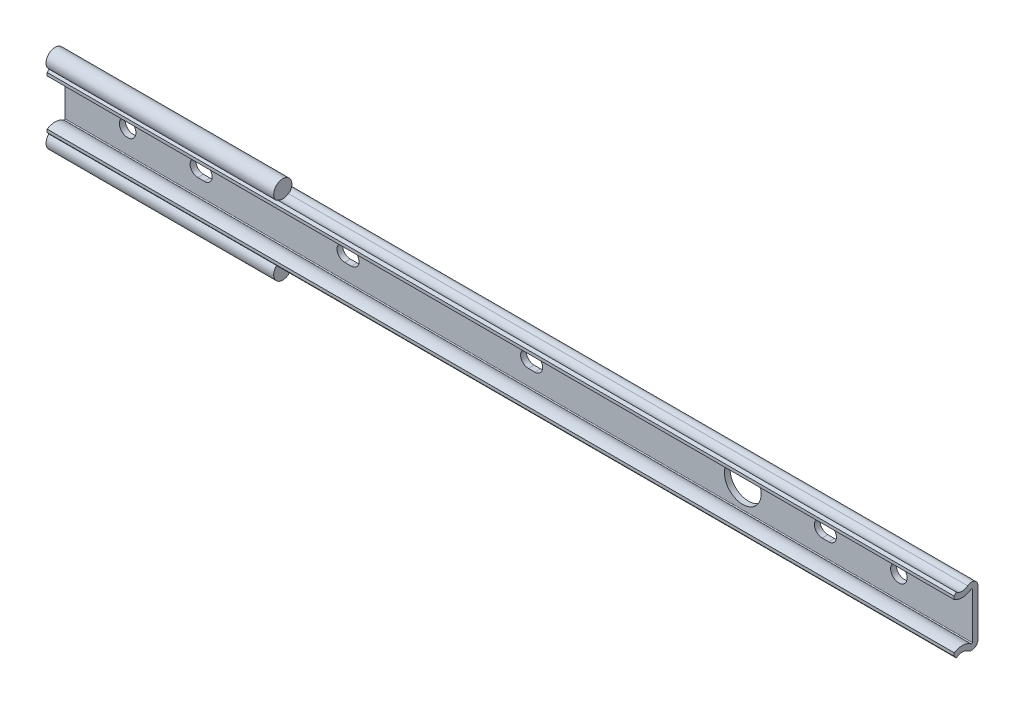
ISO-10303-21;
HEADER;
FILE_DESCRIPTION(('STEP AP214'),'2;1');
FILE_NAME('part.step','',(''),(''),'','','');
FILE_SCHEMA(('AUTOMOTIVE_DESIGN { 1 0 10303 214 1 1 1 1 }'));
ENDSEC;
DATA;
#1=APPLICATION_CONTEXT('core data for automotive mechanical design processes');
#2=APPLICATION_PROTOCOL_DEFINITION('international standard','automotive_design',2000,#1);
#3=PRODUCT_CONTEXT('',#1,'mechanical');
#4=PRODUCT('Part','Part','',(#3));
#5=PRODUCT_RELATED_PRODUCT_CATEGORY('part','',(#4));
#6=PRODUCT_DEFINITION_FORMATION('','',#4);
#7=PRODUCT_DEFINITION_CONTEXT('part definition',#1,'design');
#8=PRODUCT_DEFINITION('design','',#6,#7);
#9=PRODUCT_DEFINITION_SHAPE('','',#8);
#10=(LENGTH_UNIT() NAMED_UNIT(*) SI_UNIT(.MILLI.,.METRE.));
#11=(NAMED_UNIT(*) PLANE_ANGLE_UNIT() SI_UNIT($,.RADIAN.));
#12=(NAMED_UNIT(*) SI_UNIT($,.STERADIAN.) SOLID_ANGLE_UNIT());
#13=UNCERTAINTY_MEASURE_WITH_UNIT(LENGTH_MEASURE(1.E-05),#10,'distance_accuracy_value','');
#14=(GEOMETRIC_REPRESENTATION_CONTEXT(3) GLOBAL_UNCERTAINTY_ASSIGNED_CONTEXT((#13)) GLOBAL_UNIT_ASSIGNED_CONTEXT((#10,
#11,#12)) REPRESENTATION_CONTEXT('',''));
#15=CARTESIAN_POINT('',(0.,0.,0.));
#16=DIRECTION('',(0.,0.,1.));
#17=DIRECTION('',(1.,0.,0.));
#18=AXIS2_PLACEMENT_3D('',#15,#16,#17);
#19=CARTESIAN_POINT('',(230.,9.67006993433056,4.30999988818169));
#20=DIRECTION('',(-1.,0.,0.));
#21=DIRECTION('',(0.,1.,0.));
#22=AXIS2_PLACEMENT_3D('',#19,#20,#21);
#23=CYLINDRICAL_SURFACE('',#22,2.48);
#24=DIRECTION('',(-1.,0.,0.));
#25=VECTOR('',#24,1.);
#26=CARTESIAN_POINT('',(230.,7.6958095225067,2.80910154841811));
#27=LINE('',#26,#25);
#28=CARTESIAN_POINT('',(230.,7.6958095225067,2.80910154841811));
#29=VERTEX_POINT('',#28);
#30=CARTESIAN_POINT('',(45.,7.6958095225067,2.80910154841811));
#31=VERTEX_POINT('',#30);
#32=EDGE_CURVE('E482',#29,#31,#27,.T.);
#33=ORIENTED_EDGE('',*,*,#32,.T.);
#34=CARTESIAN_POINT('',(45.,9.67006993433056,4.30999988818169));
#35=DIRECTION('',(-1.,0.,0.));
#36=DIRECTION('',(0.,0.,1.));
#37=AXIS2_PLACEMENT_3D('',#34,#35,#36);
#38=CIRCLE('',#37,2.48);
#39=CARTESIAN_POINT('',(45.,7.77027971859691,5.9041131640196));
#40=VERTEX_POINT('',#39);
#41=EDGE_CURVE('E264',#31,#40,#38,.T.);
#42=ORIENTED_EDGE('',*,*,#41,.T.);
#43=DIRECTION('',(-1.,0.,0.));
#44=VECTOR('',#43,1.);
#45=CARTESIAN_POINT('',(230.,7.77027971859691,5.9041131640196));
#46=LINE('',#45,#44);
#47=CARTESIAN_POINT('',(230.,7.77027971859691,5.9041131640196));
#48=VERTEX_POINT('',#47);
#49=EDGE_CURVE('E485',#48,#40,#46,.T.);
#50=ORIENTED_EDGE('',*,*,#49,.F.);
#51=CARTESIAN_POINT('',(230.,9.67006993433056,4.30999988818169));
#52=DIRECTION('',(1.,0.,0.));
#53=DIRECTION('',(0.,-1.,0.));
#54=AXIS2_PLACEMENT_3D('',#51,#52,#53);
#55=CIRCLE('',#54,2.48);
#56=EDGE_CURVE('E469',#48,#29,#55,.T.);
#57=ORIENTED_EDGE('',*,*,#56,.T.);
#58=EDGE_LOOP('',(#33,#42,#50,#57));
#59=FACE_BOUND('',#58,.T.);
#60=ADVANCED_FACE('F14',(#59),#23,.F.);
#61=CARTESIAN_POINT('',(60.9,2.10000000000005,4.92000017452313));
#62=DIRECTION('',(0.,1.,0.));
#63=DIRECTION('',(0.,0.,1.));
#64=AXIS2_PLACEMENT_3D('',#61,#62,#63);
#65=PLANE('',#64);
#66=DIRECTION('',(0.,0.,-1.));
#67=VECTOR('',#66,1.);
#68=CARTESIAN_POINT('',(59.1,2.10000000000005,4.92000017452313));
#69=LINE('',#68,#67);
#70=CARTESIAN_POINT('',(59.1,2.10000000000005,1.54999999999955));
#71=VERTEX_POINT('',#70);
#72=CARTESIAN_POINT('',(59.1,2.10000000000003,0.));
#73=VERTEX_POINT('',#72);
#74=EDGE_CURVE('E428',#71,#73,#69,.T.);
#75=ORIENTED_EDGE('',*,*,#74,.T.);
#76=DIRECTION('',(1.,0.,0.));
#77=VECTOR('',#76,1.);
#78=CARTESIAN_POINT('',(60.9,2.10000000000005,0.));
#79=LINE('',#78,#77);
#80=CARTESIAN_POINT('',(60.9,2.10000000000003,0.));
#81=VERTEX_POINT('',#80);
#82=EDGE_CURVE('E283',#73,#81,#79,.T.);
#83=ORIENTED_EDGE('',*,*,#82,.T.);
#84=DIRECTION('',(0.,0.,-1.));
#85=VECTOR('',#84,1.);
#86=CARTESIAN_POINT('',(60.9,2.10000000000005,4.92000017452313));
#87=LINE('',#86,#85);
#88=CARTESIAN_POINT('',(60.9,2.10000000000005,1.54999999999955));
#89=VERTEX_POINT('',#88);
#90=EDGE_CURVE('E424',#89,#81,#87,.T.);
#91=ORIENTED_EDGE('',*,*,#90,.F.);
#92=DIRECTION('',(1.,0.,0.));
#93=VECTOR('',#92,1.);
#94=CARTESIAN_POINT('',(230.,2.10000000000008,1.54999999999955));
#95=LINE('',#94,#93);
#96=EDGE_CURVE('E337',#71,#89,#95,.T.);
#97=ORIENTED_EDGE('',*,*,#96,.F.);
#98=EDGE_LOOP('',(#75,#83,#91,#97));
#99=FACE_BOUND('',#98,.T.);
#100=ADVANCED_FACE('F610',(#99),#65,.F.);
#101=CARTESIAN_POINT('',(59.1,0.,4.92000017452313));
#102=DIRECTION('',(0.,0.,-1.));
#103=DIRECTION('',(0.,1.,0.));
#104=AXIS2_PLACEMENT_3D('',#101,#102,#103);
#105=CYLINDRICAL_SURFACE('',#104,2.1);
#106=DIRECTION('',(0.,0.,-1.));
#107=VECTOR('',#106,1.);
#108=CARTESIAN_POINT('',(59.1,-2.1,4.92000017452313));
#109=LINE('',#108,#107);
#110=CARTESIAN_POINT('',(59.1,-2.1,1.54999999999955));
#111=VERTEX_POINT('',#110);
#112=CARTESIAN_POINT('',(59.1,-2.1,0.));
#113=VERTEX_POINT('',#112);
#114=EDGE_CURVE('E431',#111,#113,#109,.T.);
#115=ORIENTED_EDGE('',*,*,#114,.T.);
#116=CARTESIAN_POINT('',(59.1,0.,0.));
#117=DIRECTION('',(0.,0.,1.));
#118=DIRECTION('',(1.,0.,0.));
#119=AXIS2_PLACEMENT_3D('',#116,#117,#118);
#120=CIRCLE('',#119,2.1);
#121=EDGE_CURVE('E280',#113,#73,#120,.F.);
#122=ORIENTED_EDGE('',*,*,#121,.T.);
#123=ORIENTED_EDGE('',*,*,#74,.F.);
#124=CARTESIAN_POINT('',(59.1,0.,1.54999999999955));
#125=DIRECTION('',(0.,0.,-1.));
#126=DIRECTION('',(-1.,0.,0.));
#127=AXIS2_PLACEMENT_3D('',#124,#125,#126);
#128=CIRCLE('',#127,2.1);
#129=EDGE_CURVE('E334',#111,#71,#128,.T.);
#130=ORIENTED_EDGE('',*,*,#129,.F.);
#131=EDGE_LOOP('',(#115,#122,#123,#130));
#132=FACE_BOUND('',#131,.T.);
#133=ADVANCED_FACE('F616',(#132),#105,.F.);
#134=CARTESIAN_POINT('',(190.9,2.10000000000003,4.92000017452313));
#135=DIRECTION('',(0.,1.,0.));
#136=DIRECTION('',(0.,0.,1.));
#137=AXIS2_PLACEMENT_3D('',#134,#135,#136);
#138=PLANE('',#137);
#139=DIRECTION('',(0.,0.,-1.));
#140=VECTOR('',#139,1.);
#141=CARTESIAN_POINT('',(189.1,2.10000000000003,4.92000017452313));
#142=LINE('',#141,#140);
#143=CARTESIAN_POINT('',(189.1,2.10000000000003,1.54999999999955));
#144=VERTEX_POINT('',#143);
#145=CARTESIAN_POINT('',(189.1,2.1,0.));
#146=VERTEX_POINT('',#145);
#147=EDGE_CURVE('E416',#144,#146,#142,.T.);
#148=ORIENTED_EDGE('',*,*,#147,.T.);
#149=DIRECTION('',(1.,0.,0.));
#150=VECTOR('',#149,1.);
#151=CARTESIAN_POINT('',(190.9,2.10000000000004,0.));
#152=LINE('',#151,#150);
#153=CARTESIAN_POINT('',(190.9,2.1,0.));
#154=VERTEX_POINT('',#153);
#155=EDGE_CURVE('E301',#146,#154,#152,.T.);
#156=ORIENTED_EDGE('',*,*,#155,.T.);
#157=DIRECTION('',(0.,0.,-1.));
#158=VECTOR('',#157,1.);
#159=CARTESIAN_POINT('',(190.9,2.10000000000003,4.92000017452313));
#160=LINE('',#159,#158);
#161=CARTESIAN_POINT('',(190.9,2.10000000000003,1.54999999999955));
#162=VERTEX_POINT('',#161);
#163=EDGE_CURVE('E412',#162,#154,#160,.T.);
#164=ORIENTED_EDGE('',*,*,#163,.F.);
#165=DIRECTION('',(1.,0.,0.));
#166=VECTOR('',#165,1.);
#167=CARTESIAN_POINT('',(230.,2.10000000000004,1.54999999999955));
#168=LINE('',#167,#166);
#169=EDGE_CURVE('E355',#144,#162,#168,.T.);
#170=ORIENTED_EDGE('',*,*,#169,.F.);
#171=EDGE_LOOP('',(#148,#156,#164,#170));
#172=FACE_BOUND('',#171,.T.);
#173=ADVANCED_FACE('F705',(#172),#138,.F.);
#174=CARTESIAN_POINT('',(189.1,0.,4.92000017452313));
#175=DIRECTION('',(0.,0.,-1.));
#176=DIRECTION('',(0.,1.,0.));
#177=AXIS2_PLACEMENT_3D('',#174,#175,#176);
#178=CYLINDRICAL_SURFACE('',#177,2.1);
#179=DIRECTION('',(0.,0.,-1.));
#180=VECTOR('',#179,1.);
#181=CARTESIAN_POINT('',(189.1,-2.1,4.92000017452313));
#182=LINE('',#181,#180);
#183=CARTESIAN_POINT('',(189.1,-2.1,1.54999999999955));
#184=VERTEX_POINT('',#183);
#185=CARTESIAN_POINT('',(189.1,-2.1,0.));
#186=VERTEX_POINT('',#185);
#187=EDGE_CURVE('E419',#184,#186,#182,.T.);
#188=ORIENTED_EDGE('',*,*,#187,.T.);
#189=CARTESIAN_POINT('',(189.1,0.,0.));
#190=DIRECTION('',(0.,0.,1.));
#191=DIRECTION('',(1.,0.,0.));
#192=AXIS2_PLACEMENT_3D('',#189,#190,#191);
#193=CIRCLE('',#192,2.1);
#194=EDGE_CURVE('E298',#186,#146,#193,.F.);
#195=ORIENTED_EDGE('',*,*,#194,.T.);
#196=ORIENTED_EDGE('',*,*,#147,.F.);
#197=CARTESIAN_POINT('',(189.1,0.,1.54999999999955));
#198=DIRECTION('',(0.,0.,-1.));
#199=DIRECTION('',(-1.,0.,0.));
#200=AXIS2_PLACEMENT_3D('',#197,#198,#199);
#201=CIRCLE('',#200,2.1);
#202=EDGE_CURVE('E352',#184,#144,#201,.T.);
#203=ORIENTED_EDGE('',*,*,#202,.F.);
#204=EDGE_LOOP('',(#188,#195,#196,#203));
#205=FACE_BOUND('',#204,.T.);
#206=ADVANCED_FACE('F692',(#205),#178,.F.);
#207=CARTESIAN_POINT('',(109.100000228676,-2.09326771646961,4.92000017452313));
#208=DIRECTION('',(0.,-1.,0.));
#209=DIRECTION('',(-1.,0.,0.));
#210=AXIS2_PLACEMENT_3D('',#207,#208,#209);
#211=PLANE('',#210);
#212=DIRECTION('',(0.,0.,-1.));
#213=VECTOR('',#212,1.);
#214=CARTESIAN_POINT('',(110.900000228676,-2.09326771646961,4.92000017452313));
#215=LINE('',#214,#213);
#216=CARTESIAN_POINT('',(110.900000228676,-2.09326771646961,1.54999999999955));
#217=VERTEX_POINT('',#216);
#218=CARTESIAN_POINT('',(110.900000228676,-2.09326771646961,0.));
#219=VERTEX_POINT('',#218);
#220=EDGE_CURVE('E404',#217,#219,#215,.T.);
#221=ORIENTED_EDGE('',*,*,#220,.T.);
#222=DIRECTION('',(-1.,0.,0.));
#223=VECTOR('',#222,1.);
#224=CARTESIAN_POINT('',(109.100000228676,-2.09326771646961,0.));
#225=LINE('',#224,#223);
#226=CARTESIAN_POINT('',(109.100000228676,-2.09326771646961,0.));
#227=VERTEX_POINT('',#226);
#228=EDGE_CURVE('E313',#219,#227,#225,.T.);
#229=ORIENTED_EDGE('',*,*,#228,.T.);
#230=DIRECTION('',(0.,0.,-1.));
#231=VECTOR('',#230,1.);
#232=CARTESIAN_POINT('',(109.100000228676,-2.09326771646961,4.92000017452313));
#233=LINE('',#232,#231);
#234=CARTESIAN_POINT('',(109.100000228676,-2.09326771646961,1.54999999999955));
#235=VERTEX_POINT('',#234);
#236=EDGE_CURVE('E400',#235,#227,#233,.T.);
#237=ORIENTED_EDGE('',*,*,#236,.F.);
#238=DIRECTION('',(-1.,0.,0.));
#239=VECTOR('',#238,1.);
#240=CARTESIAN_POINT('',(230.,-2.09326771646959,1.54999999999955));
#241=LINE('',#240,#239);
#242=EDGE_CURVE('E367',#217,#235,#241,.T.);
#243=ORIENTED_EDGE('',*,*,#242,.F.);
#244=EDGE_LOOP('',(#221,#229,#237,#243));
#245=FACE_BOUND('',#244,.T.);
#246=ADVANCED_FACE('F689',(#245),#211,.F.);
#247=CARTESIAN_POINT('',(110.900000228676,0.00673228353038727,4.92000017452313));
#248=DIRECTION('',(0.,0.,-1.));
#249=DIRECTION('',(0.,1.,0.));
#250=AXIS2_PLACEMENT_3D('',#247,#248,#249);
#251=CYLINDRICAL_SURFACE('',#250,2.1);
#252=DIRECTION('',(0.,0.,-1.));
#253=VECTOR('',#252,1.);
#254=CARTESIAN_POINT('',(110.900000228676,2.10673228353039,4.92000017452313));
#255=LINE('',#254,#253);
#256=CARTESIAN_POINT('',(110.900000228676,2.10673228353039,1.54999999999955));
#257=VERTEX_POINT('',#256);
#258=CARTESIAN_POINT('',(110.900000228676,2.10673228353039,0.));
#259=VERTEX_POINT('',#258);
#260=EDGE_CURVE('E407',#257,#259,#255,.T.);
#261=ORIENTED_EDGE('',*,*,#260,.T.);
#262=CARTESIAN_POINT('',(110.900000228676,0.0067322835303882,0.));
#263=DIRECTION('',(0.,0.,1.));
#264=DIRECTION('',(1.,0.,0.));
#265=AXIS2_PLACEMENT_3D('',#262,#263,#264);
#266=CIRCLE('',#265,2.1);
#267=EDGE_CURVE('E310',#259,#219,#266,.F.);
#268=ORIENTED_EDGE('',*,*,#267,.T.);
#269=ORIENTED_EDGE('',*,*,#220,.F.);
#270=CARTESIAN_POINT('',(110.900000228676,0.0067322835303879,1.54999999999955));
#271=DIRECTION('',(0.,0.,-1.));
#272=DIRECTION('',(-1.,0.,0.));
#273=AXIS2_PLACEMENT_3D('',#270,#271,#272);
#274=CIRCLE('',#273,2.1);
#275=EDGE_CURVE('E364',#257,#217,#274,.T.);
#276=ORIENTED_EDGE('',*,*,#275,.F.);
#277=EDGE_LOOP('',(#261,#268,#269,#276));
#278=FACE_BOUND('',#277,.T.);
#279=ADVANCED_FACE('F677',(#278),#251,.F.);
#280=CARTESIAN_POINT('',(19.1,2.10000000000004,4.92100017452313));
#281=DIRECTION('',(0.,1.,0.));
#282=DIRECTION('',(0.,0.,1.));
#283=AXIS2_PLACEMENT_3D('',#280,#281,#282);
#284=PLANE('',#283);
#285=DIRECTION('',(0.,0.,-1.));
#286=VECTOR('',#285,1.);
#287=CARTESIAN_POINT('',(19.1,2.10000000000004,4.92100017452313));
#288=LINE('',#287,#286);
#289=CARTESIAN_POINT('',(19.1,2.10000000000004,1.54999999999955));
#290=VERTEX_POINT('',#289);
#291=CARTESIAN_POINT('',(19.1,2.1,0.));
#292=VERTEX_POINT('',#291);
#293=EDGE_CURVE('E390',#290,#292,#288,.T.);
#294=ORIENTED_EDGE('',*,*,#293,.T.);
#295=DIRECTION('',(1.,0.,0.));
#296=VECTOR('',#295,1.);
#297=CARTESIAN_POINT('',(19.1,2.10000000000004,0.));
#298=LINE('',#297,#296);
#299=CARTESIAN_POINT('',(20.9,2.10000000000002,0.));
#300=VERTEX_POINT('',#299);
#301=EDGE_CURVE('E325',#292,#300,#298,.T.);
#302=ORIENTED_EDGE('',*,*,#301,.T.);
#303=DIRECTION('',(0.,0.,-1.));
#304=VECTOR('',#303,1.);
#305=CARTESIAN_POINT('',(20.9,2.10000000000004,4.92100017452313));
#306=LINE('',#305,#304);
#307=CARTESIAN_POINT('',(20.9,2.10000000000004,1.54999999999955));
#308=VERTEX_POINT('',#307);
#309=EDGE_CURVE('E386',#308,#300,#306,.T.);
#310=ORIENTED_EDGE('',*,*,#309,.F.);
#311=DIRECTION('',(1.,0.,0.));
#312=VECTOR('',#311,1.);
#313=CARTESIAN_POINT('',(230.,2.10000000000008,1.54999999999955));
#314=LINE('',#313,#312);
#315=EDGE_CURVE('E373',#290,#308,#314,.T.);
#316=ORIENTED_EDGE('',*,*,#315,.F.);
#317=EDGE_LOOP('',(#294,#302,#310,#316));
#318=FACE_BOUND('',#317,.T.);
#319=ADVANCED_FACE('F670',(#318),#284,.F.);
#320=CARTESIAN_POINT('',(19.1,0.,4.92100017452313));
#321=DIRECTION('',(0.,0.,-1.));
#322=DIRECTION('',(0.,1.,0.));
#323=AXIS2_PLACEMENT_3D('',#320,#321,#322);
#324=CYLINDRICAL_SURFACE('',#323,2.1);
#325=DIRECTION('',(0.,0.,-1.));
#326=VECTOR('',#325,1.);
#327=CARTESIAN_POINT('',(19.1,-2.1,4.92100017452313));
#328=LINE('',#327,#326);
#329=CARTESIAN_POINT('',(19.1,-2.1,1.54999999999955));
#330=VERTEX_POINT('',#329);
#331=CARTESIAN_POINT('',(19.1,-2.1,0.));
#332=VERTEX_POINT('',#331);
#333=EDGE_CURVE('E393',#330,#332,#328,.T.);
#334=ORIENTED_EDGE('',*,*,#333,.T.);
#335=CARTESIAN_POINT('',(19.1,0.,0.));
#336=DIRECTION('',(0.,0.,1.));
#337=DIRECTION('',(1.,0.,0.));
#338=AXIS2_PLACEMENT_3D('',#335,#336,#337);
#339=CIRCLE('',#338,2.1);
#340=EDGE_CURVE('E322',#332,#292,#339,.F.);
#341=ORIENTED_EDGE('',*,*,#340,.T.);
#342=ORIENTED_EDGE('',*,*,#293,.F.);
#343=CARTESIAN_POINT('',(19.1,0.,1.54999999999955));
#344=DIRECTION('',(0.,0.,-1.));
#345=DIRECTION('',(-1.,0.,0.));
#346=AXIS2_PLACEMENT_3D('',#343,#344,#345);
#347=CIRCLE('',#346,2.1);
#348=EDGE_CURVE('E382',#330,#290,#347,.T.);
#349=ORIENTED_EDGE('',*,*,#348,.F.);
#350=EDGE_LOOP('',(#334,#341,#342,#349));
#351=FACE_BOUND('',#350,.T.);
#352=ADVANCED_FACE('F665',(#351),#324,.F.);
#353=CARTESIAN_POINT('',(230.,-6.29881728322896,0.19999971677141));
#354=DIRECTION('',(1.,0.,0.));
#355=DIRECTION('',(0.,0.,-1.));
#356=AXIS2_PLACEMENT_3D('',#353,#354,#355);
#357=PLANE('',#356);
#358=DIRECTION('',(0.,1.,0.));
#359=VECTOR('',#358,1.);
#360=CARTESIAN_POINT('',(230.,-6.30268270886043,0.));
#361=LINE('',#360,#359);
#362=CARTESIAN_POINT('',(230.,-6.30268270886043,0.));
#363=VERTEX_POINT('',#362);
#364=CARTESIAN_POINT('',(230.,6.30268270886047,0.));
#365=VERTEX_POINT('',#364);
#366=EDGE_CURVE('E499',#363,#365,#361,.T.);
#367=ORIENTED_EDGE('',*,*,#366,.T.);
#368=CARTESIAN_POINT('',(230.,6.30268270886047,1.74999971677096));
#369=DIRECTION('',(-1.,0.,0.));
#370=DIRECTION('',(0.,-1.,0.));
#371=AXIS2_PLACEMENT_3D('',#368,#369,#370);
#372=CIRCLE('',#371,1.74999971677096);
#373=EDGE_CURVE('E472',#29,#365,#372,.T.);
#374=ORIENTED_EDGE('',*,*,#373,.F.);
#375=ORIENTED_EDGE('',*,*,#56,.F.);
#376=DIRECTION('',(0.,0.766044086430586,-0.642788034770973));
#377=VECTOR('',#376,1.);
#378=CARTESIAN_POINT('',(230.,7.77027971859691,5.9041131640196));
#379=LINE('',#378,#377);
#380=CARTESIAN_POINT('',(230.,7.09588264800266,6.47000013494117));
#381=VERTEX_POINT('',#380);
#382=EDGE_CURVE('E466',#381,#48,#379,.T.);
#383=ORIENTED_EDGE('',*,*,#382,.F.);
#384=DIRECTION('',(0.,1.,0.));
#385=VECTOR('',#384,1.);
#386=CARTESIAN_POINT('',(230.,7.09588264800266,6.47000013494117));
#387=LINE('',#386,#385);
#388=CARTESIAN_POINT('',(230.,6.26782080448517,6.47000013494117));
#389=VERTEX_POINT('',#388);
#390=EDGE_CURVE('E463',#389,#381,#387,.T.);
#391=ORIENTED_EDGE('',*,*,#390,.F.);
#392=CARTESIAN_POINT('',(230.,9.67006996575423,4.30999991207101));
#393=DIRECTION('',(-1.,0.,0.));
#394=DIRECTION('',(0.,-1.,0.));
#395=AXIS2_PLACEMENT_3D('',#392,#393,#394);
#396=CIRCLE('',#395,4.03000003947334);
#397=CARTESIAN_POINT('',(230.,6.46189676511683,1.87104008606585));
#398=VERTEX_POINT('',#397);
#399=EDGE_CURVE('E460',#398,#389,#396,.T.);
#400=ORIENTED_EDGE('',*,*,#399,.F.);
#401=CARTESIAN_POINT('',(230.,6.30268270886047,1.74999971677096));
#402=DIRECTION('',(1.,0.,0.));
#403=DIRECTION('',(0.,-1.,0.));
#404=AXIS2_PLACEMENT_3D('',#401,#402,#403);
#405=CIRCLE('',#404,0.199999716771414);
#406=CARTESIAN_POINT('',(230.,6.30268270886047,1.54999999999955));
#407=VERTEX_POINT('',#406);
#408=EDGE_CURVE('E455',#407,#398,#405,.T.);
#409=ORIENTED_EDGE('',*,*,#408,.F.);
#410=DIRECTION('',(0.,-1.,0.));
#411=VECTOR('',#410,1.);
#412=CARTESIAN_POINT('',(230.,-6.30268270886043,1.54999999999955));
#413=LINE('',#412,#411);
#414=CARTESIAN_POINT('',(230.,-6.30268270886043,1.54999999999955));
#415=VERTEX_POINT('',#414);
#416=EDGE_CURVE('E501',#407,#415,#413,.T.);
#417=ORIENTED_EDGE('',*,*,#416,.T.);
#418=CARTESIAN_POINT('',(230.,-6.30268270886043,1.74999971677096));
#419=DIRECTION('',(-1.,0.,0.));
#420=DIRECTION('',(0.,0.,-1.));
#421=AXIS2_PLACEMENT_3D('',#418,#419,#420);
#422=CIRCLE('',#421,0.199999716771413);
#423=CARTESIAN_POINT('',(230.,-6.46189676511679,1.87104008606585));
#424=VERTEX_POINT('',#423);
#425=EDGE_CURVE('E503',#415,#424,#422,.T.);
#426=ORIENTED_EDGE('',*,*,#425,.T.);
#427=CARTESIAN_POINT('',(230.,-9.67006993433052,4.30999988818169));
#428=DIRECTION('',(1.,0.,0.));
#429=DIRECTION('',(0.,0.,-1.));
#430=AXIS2_PLACEMENT_3D('',#427,#428,#429);
#431=CIRCLE('',#430,4.03);
#432=CARTESIAN_POINT('',(230.,-6.26782067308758,6.46999987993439));
#433=VERTEX_POINT('',#432);
#434=EDGE_CURVE('E505',#424,#433,#431,.T.);
#435=ORIENTED_EDGE('',*,*,#434,.T.);
#436=DIRECTION('',(0.,-1.,0.));
#437=VECTOR('',#436,1.);
#438=CARTESIAN_POINT('',(230.,-6.26782067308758,6.46999987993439));
#439=LINE('',#438,#437);
#440=CARTESIAN_POINT('',(230.,-7.09588293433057,6.46999987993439));
#441=VERTEX_POINT('',#440);
#442=EDGE_CURVE('E507',#433,#441,#439,.T.);
#443=ORIENTED_EDGE('',*,*,#442,.T.);
#444=DIRECTION('',(0.,-0.766044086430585,-0.642788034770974));
#445=VECTOR('',#444,1.);
#446=CARTESIAN_POINT('',(230.,-7.7702797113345,5.90411315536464));
#447=LINE('',#446,#445);
#448=CARTESIAN_POINT('',(230.,-7.7702797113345,5.90411315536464));
#449=VERTEX_POINT('',#448);
#450=EDGE_CURVE('E509',#441,#449,#447,.T.);
#451=ORIENTED_EDGE('',*,*,#450,.T.);
#452=CARTESIAN_POINT('',(230.,-9.67006993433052,4.30999988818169));
#453=DIRECTION('',(-1.,0.,0.));
#454=DIRECTION('',(0.,0.,-1.));
#455=AXIS2_PLACEMENT_3D('',#452,#453,#454);
#456=CIRCLE('',#455,2.48);
#457=CARTESIAN_POINT('',(230.,-7.69580952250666,2.80910154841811));
#458=VERTEX_POINT('',#457);
#459=EDGE_CURVE('E511',#449,#458,#456,.T.);
#460=ORIENTED_EDGE('',*,*,#459,.T.);
#461=CARTESIAN_POINT('',(230.,-6.30268270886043,1.74999971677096));
#462=DIRECTION('',(1.,0.,0.));
#463=DIRECTION('',(0.,0.,-1.));
#464=AXIS2_PLACEMENT_3D('',#461,#462,#463);
#465=CIRCLE('',#464,1.74999971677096);
#466=EDGE_CURVE('E497',#458,#363,#465,.T.);
#467=ORIENTED_EDGE('',*,*,#466,.T.);
#468=EDGE_LOOP('',(#367,#374,#375,#383,#391,#400,#409,#417,#426,#435,#443,#451,#460,#467));
#469=FACE_BOUND('',#468,.T.);
#470=ADVANCED_FACE('F550',(#469),#357,.T.);
#471=CARTESIAN_POINT('',(-17.,-6.298817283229,0.19999971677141));
#472=DIRECTION('',(1.,0.,0.));
#473=DIRECTION('',(0.,0.,-1.));
#474=AXIS2_PLACEMENT_3D('',#471,#472,#473);
#475=PLANE('',#474);
#476=CARTESIAN_POINT('',(-17.,-6.30268270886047,1.74999971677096));
#477=DIRECTION('',(1.,0.,0.));
#478=DIRECTION('',(0.,0.,-1.));
#479=AXIS2_PLACEMENT_3D('',#476,#477,#478);
#480=CIRCLE('',#479,1.74999971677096);
#481=CARTESIAN_POINT('',(-17.,-7.94505035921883,2.35425753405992));
#482=VERTEX_POINT('',#481);
#483=CARTESIAN_POINT('',(-17.,-6.30268270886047,0.));
#484=VERTEX_POINT('',#483);
#485=EDGE_CURVE('E233',#482,#484,#480,.T.);
#486=ORIENTED_EDGE('',*,*,#485,.F.);
#487=CARTESIAN_POINT('',(-17.,-9.47,4.31));
#488=DIRECTION('',(-1.,0.,0.));
#489=DIRECTION('',(0.,0.,-1.));
#490=AXIS2_PLACEMENT_3D('',#487,#488,#489);
#491=CIRCLE('',#490,2.48);
#492=CARTESIAN_POINT('',(-17.,-7.6554298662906,6.00048372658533));
#493=VERTEX_POINT('',#492);
#494=EDGE_CURVE('E236',#482,#493,#491,.T.);
#495=ORIENTED_EDGE('',*,*,#494,.T.);
#496=DIRECTION('',(0.,-0.766044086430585,-0.642788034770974));
#497=VECTOR('',#496,1.);
#498=CARTESIAN_POINT('',(-17.,-7.77027971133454,5.90411315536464));
#499=LINE('',#498,#497);
#500=CARTESIAN_POINT('',(-17.,-7.09588258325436,6.47000017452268));
#501=VERTEX_POINT('',#500);
#502=EDGE_CURVE('E34',#501,#493,#499,.T.);
#503=ORIENTED_EDGE('',*,*,#502,.F.);
#504=DIRECTION('',(0.,-1.,0.));
#505=VECTOR('',#504,1.);
#506=CARTESIAN_POINT('',(-17.,-7.09588258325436,6.47000017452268));
#507=LINE('',#506,#505);
#508=CARTESIAN_POINT('',(-17.,-6.26782067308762,6.47000017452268));
#509=VERTEX_POINT('',#508);
#510=EDGE_CURVE('E449',#509,#501,#507,.T.);
#511=ORIENTED_EDGE('',*,*,#510,.F.);
#512=CARTESIAN_POINT('',(-17.,-9.67006993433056,4.30999988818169));
#513=DIRECTION('',(1.,0.,0.));
#514=DIRECTION('',(0.,0.,-1.));
#515=AXIS2_PLACEMENT_3D('',#512,#513,#514);
#516=CIRCLE('',#515,4.03000011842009);
#517=CARTESIAN_POINT('',(-17.,-6.46189667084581,1.87104001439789));
#518=VERTEX_POINT('',#517);
#519=EDGE_CURVE('E446',#518,#509,#516,.T.);
#520=ORIENTED_EDGE('',*,*,#519,.F.);
#521=CARTESIAN_POINT('',(-17.,-6.30268270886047,1.74999971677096));
#522=DIRECTION('',(1.,0.,0.));
#523=DIRECTION('',(0.,0.,-1.));
#524=AXIS2_PLACEMENT_3D('',#521,#522,#523);
#525=CIRCLE('',#524,0.199999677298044);
#526=CARTESIAN_POINT('',(-17.,-6.30268270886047,1.54999999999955));
#527=VERTEX_POINT('',#526);
#528=EDGE_CURVE('E242',#527,#518,#525,.F.);
#529=ORIENTED_EDGE('',*,*,#528,.F.);
#530=DIRECTION('',(0.,-1.,0.));
#531=VECTOR('',#530,1.);
#532=CARTESIAN_POINT('',(-17.,-6.30268270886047,1.54999999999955));
#533=LINE('',#532,#531);
#534=CARTESIAN_POINT('',(-17.,6.30268270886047,1.54999999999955));
#535=VERTEX_POINT('',#534);
#536=EDGE_CURVE('E495',#535,#527,#533,.T.);
#537=ORIENTED_EDGE('',*,*,#536,.F.);
#538=CARTESIAN_POINT('',(-17.,6.30268270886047,1.74999971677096));
#539=DIRECTION('',(1.,0.,0.));
#540=DIRECTION('',(0.,0.,-1.));
#541=AXIS2_PLACEMENT_3D('',#538,#539,#540);
#542=CIRCLE('',#541,0.199999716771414);
#543=CARTESIAN_POINT('',(-17.,6.46189676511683,1.87104008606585));
#544=VERTEX_POINT('',#543);
#545=EDGE_CURVE('E385',#544,#535,#542,.F.);
#546=ORIENTED_EDGE('',*,*,#545,.F.);
#547=CARTESIAN_POINT('',(-17.,9.67006996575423,4.30999991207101));
#548=DIRECTION('',(1.,0.,0.));
#549=DIRECTION('',(0.,0.,-1.));
#550=AXIS2_PLACEMENT_3D('',#547,#548,#549);
#551=CIRCLE('',#550,4.03000003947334);
#552=CARTESIAN_POINT('',(-17.,6.26782080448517,6.47000013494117));
#553=VERTEX_POINT('',#552);
#554=EDGE_CURVE('E443',#553,#544,#551,.T.);
#555=ORIENTED_EDGE('',*,*,#554,.F.);
#556=DIRECTION('',(0.,-1.,0.));
#557=VECTOR('',#556,1.);
#558=CARTESIAN_POINT('',(-17.,6.26782080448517,6.47000013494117));
#559=LINE('',#558,#557);
#560=CARTESIAN_POINT('',(-17.,7.09588264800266,6.47000013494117));
#561=VERTEX_POINT('',#560);
#562=EDGE_CURVE('E440',#561,#553,#559,.T.);
#563=ORIENTED_EDGE('',*,*,#562,.F.);
#564=DIRECTION('',(0.,-0.766044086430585,0.642788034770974));
#565=VECTOR('',#564,1.);
#566=CARTESIAN_POINT('',(-17.,7.09588264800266,6.47000013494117));
#567=LINE('',#566,#565);
#568=CARTESIAN_POINT('',(-17.,7.65542987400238,6.00048373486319));
#569=VERTEX_POINT('',#568);
#570=EDGE_CURVE('E438',#569,#561,#567,.T.);
#571=ORIENTED_EDGE('',*,*,#570,.F.);
#572=CARTESIAN_POINT('',(-17.,9.47,4.31));
#573=DIRECTION('',(-1.,0.,0.));
#574=DIRECTION('',(0.,0.,1.));
#575=AXIS2_PLACEMENT_3D('',#572,#573,#574);
#576=CIRCLE('',#575,2.48);
#577=CARTESIAN_POINT('',(-17.,7.94505035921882,2.35425753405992));
#578=VERTEX_POINT('',#577);
#579=EDGE_CURVE('E260',#569,#578,#576,.T.);
#580=ORIENTED_EDGE('',*,*,#579,.T.);
#581=CARTESIAN_POINT('',(-17.,6.30268270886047,1.74999971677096));
#582=DIRECTION('',(1.,0.,0.));
#583=DIRECTION('',(0.,0.,-1.));
#584=AXIS2_PLACEMENT_3D('',#581,#582,#583);
#585=CIRCLE('',#584,1.74999971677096);
#586=CARTESIAN_POINT('',(-17.,6.30268270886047,0.));
#587=VERTEX_POINT('',#586);
#588=EDGE_CURVE('E436',#587,#578,#585,.T.);
#589=ORIENTED_EDGE('',*,*,#588,.F.);
#590=DIRECTION('',(0.,1.,0.));
#591=VECTOR('',#590,1.);
#592=CARTESIAN_POINT('',(-17.,-6.30268270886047,0.));
#593=LINE('',#592,#591);
#594=EDGE_CURVE('E238',#484,#587,#593,.T.);
#595=ORIENTED_EDGE('',*,*,#594,.F.);
#596=EDGE_LOOP('',(#486,#495,#503,#511,#520,#529,#537,#546,#555,#563,#571,#580,#589,#595));
#597=FACE_BOUND('',#596,.T.);
#598=ADVANCED_FACE('F234',(#597),#475,.F.);
#599=CARTESIAN_POINT('',(20.9,0.,4.92100017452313));
#600=DIRECTION('',(0.,0.,-1.));
#601=DIRECTION('',(0.,1.,0.));
#602=AXIS2_PLACEMENT_3D('',#599,#600,#601);
#603=CYLINDRICAL_SURFACE('',#602,2.1);
#604=ORIENTED_EDGE('',*,*,#309,.T.);
#605=CARTESIAN_POINT('',(20.9,0.,0.));
#606=DIRECTION('',(0.,0.,1.));
#607=DIRECTION('',(1.,0.,0.));
#608=AXIS2_PLACEMENT_3D('',#605,#606,#607);
#609=CIRCLE('',#608,2.1);
#610=CARTESIAN_POINT('',(20.9,-2.1,0.));
#611=VERTEX_POINT('',#610);
#612=EDGE_CURVE('E319',#300,#611,#609,.F.);
#613=ORIENTED_EDGE('',*,*,#612,.T.);
#614=DIRECTION('',(0.,0.,-1.));
#615=VECTOR('',#614,1.);
#616=CARTESIAN_POINT('',(20.9,-2.1,4.92100017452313));
#617=LINE('',#616,#615);
#618=CARTESIAN_POINT('',(20.9,-2.1,1.54999999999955));
#619=VERTEX_POINT('',#618);
#620=EDGE_CURVE('E396',#619,#611,#617,.T.);
#621=ORIENTED_EDGE('',*,*,#620,.F.);
#622=CARTESIAN_POINT('',(20.9,0.,1.54999999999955));
#623=DIRECTION('',(0.,0.,-1.));
#624=DIRECTION('',(-1.,0.,0.));
#625=AXIS2_PLACEMENT_3D('',#622,#623,#624);
#626=CIRCLE('',#625,2.1);
#627=EDGE_CURVE('E376',#308,#619,#626,.T.);
#628=ORIENTED_EDGE('',*,*,#627,.F.);
#629=EDGE_LOOP('',(#604,#613,#621,#628));
#630=FACE_BOUND('',#629,.T.);
#631=ADVANCED_FACE('F663',(#630),#603,.F.);
#632=CARTESIAN_POINT('',(20.9,-2.1,4.92100017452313));
#633=DIRECTION('',(0.,-1.,0.));
#634=DIRECTION('',(0.,0.,-1.));
#635=AXIS2_PLACEMENT_3D('',#632,#633,#634);
#636=PLANE('',#635);
#637=ORIENTED_EDGE('',*,*,#620,.T.);
#638=DIRECTION('',(-1.,0.,0.));
#639=VECTOR('',#638,1.);
#640=CARTESIAN_POINT('',(20.9,-2.1,0.));
#641=LINE('',#640,#639);
#642=EDGE_CURVE('E316',#611,#332,#641,.T.);
#643=ORIENTED_EDGE('',*,*,#642,.T.);
#644=ORIENTED_EDGE('',*,*,#333,.F.);
#645=DIRECTION('',(-1.,0.,0.));
#646=VECTOR('',#645,1.);
#647=CARTESIAN_POINT('',(230.,-2.09999999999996,1.54999999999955));
#648=LINE('',#647,#646);
#649=EDGE_CURVE('E379',#619,#330,#648,.T.);
#650=ORIENTED_EDGE('',*,*,#649,.F.);
#651=EDGE_LOOP('',(#637,#643,#644,#650));
#652=FACE_BOUND('',#651,.T.);
#653=ADVANCED_FACE('F681',(#652),#636,.F.);
#654=CARTESIAN_POINT('',(109.100000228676,0.00673228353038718,4.92000017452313));
#655=DIRECTION('',(0.,0.,-1.));
#656=DIRECTION('',(0.,1.,0.));
#657=AXIS2_PLACEMENT_3D('',#654,#655,#656);
#658=CYLINDRICAL_SURFACE('',#657,2.1);
#659=ORIENTED_EDGE('',*,*,#236,.T.);
#660=CARTESIAN_POINT('',(109.100000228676,0.00673228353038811,0.));
#661=DIRECTION('',(0.,0.,1.));
#662=DIRECTION('',(1.,0.,0.));
#663=AXIS2_PLACEMENT_3D('',#660,#661,#662);
#664=CIRCLE('',#663,2.1);
#665=CARTESIAN_POINT('',(109.100000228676,2.10673228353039,0.));
#666=VERTEX_POINT('',#665);
#667=EDGE_CURVE('E307',#227,#666,#664,.F.);
#668=ORIENTED_EDGE('',*,*,#667,.T.);
#669=DIRECTION('',(0.,0.,-1.));
#670=VECTOR('',#669,1.);
#671=CARTESIAN_POINT('',(109.100000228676,2.10673228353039,4.92000017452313));
#672=LINE('',#671,#670);
#673=CARTESIAN_POINT('',(109.100000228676,2.10673228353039,1.54999999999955));
#674=VERTEX_POINT('',#673);
#675=EDGE_CURVE('E389',#674,#666,#672,.T.);
#676=ORIENTED_EDGE('',*,*,#675,.F.);
#677=CARTESIAN_POINT('',(109.100000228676,0.00673228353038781,1.54999999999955));
#678=DIRECTION('',(0.,0.,-1.));
#679=DIRECTION('',(-1.,0.,0.));
#680=AXIS2_PLACEMENT_3D('',#677,#678,#679);
#681=CIRCLE('',#680,2.1);
#682=EDGE_CURVE('E370',#235,#674,#681,.T.);
#683=ORIENTED_EDGE('',*,*,#682,.F.);
#684=EDGE_LOOP('',(#659,#668,#676,#683));
#685=FACE_BOUND('',#684,.T.);
#686=ADVANCED_FACE('F684',(#685),#658,.F.);
#687=CARTESIAN_POINT('',(109.100000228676,2.10673228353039,4.92000017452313));
#688=DIRECTION('',(0.,1.,0.));
#689=DIRECTION('',(0.,0.,1.));
#690=AXIS2_PLACEMENT_3D('',#687,#688,#689);
#691=PLANE('',#690);
#692=ORIENTED_EDGE('',*,*,#675,.T.);
#693=DIRECTION('',(1.,0.,0.));
#694=VECTOR('',#693,1.);
#695=CARTESIAN_POINT('',(109.100000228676,2.10673228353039,0.));
#696=LINE('',#695,#694);
#697=EDGE_CURVE('E304',#666,#259,#696,.T.);
#698=ORIENTED_EDGE('',*,*,#697,.T.);
#699=ORIENTED_EDGE('',*,*,#260,.F.);
#700=DIRECTION('',(1.,0.,0.));
#701=VECTOR('',#700,1.);
#702=CARTESIAN_POINT('',(230.,2.10673228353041,1.54999999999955));
#703=LINE('',#702,#701);
#704=EDGE_CURVE('E361',#674,#257,#703,.T.);
#705=ORIENTED_EDGE('',*,*,#704,.F.);
#706=EDGE_LOOP('',(#692,#698,#699,#705));
#707=FACE_BOUND('',#706,.T.);
#708=ADVANCED_FACE('F697',(#707),#691,.F.);
#709=CARTESIAN_POINT('',(190.9,0.,4.92000017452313));
#710=DIRECTION('',(0.,0.,-1.));
#711=DIRECTION('',(0.,1.,0.));
#712=AXIS2_PLACEMENT_3D('',#709,#710,#711);
#713=CYLINDRICAL_SURFACE('',#712,2.1);
#714=ORIENTED_EDGE('',*,*,#163,.T.);
#715=CARTESIAN_POINT('',(190.9,0.,0.));
#716=DIRECTION('',(0.,0.,1.));
#717=DIRECTION('',(1.,0.,0.));
#718=AXIS2_PLACEMENT_3D('',#715,#716,#717);
#719=CIRCLE('',#718,2.1);
#720=CARTESIAN_POINT('',(190.9,-2.1,0.));
#721=VERTEX_POINT('',#720);
#722=EDGE_CURVE('E295',#154,#721,#719,.F.);
#723=ORIENTED_EDGE('',*,*,#722,.T.);
#724=DIRECTION('',(0.,0.,-1.));
#725=VECTOR('',#724,1.);
#726=CARTESIAN_POINT('',(190.9,-2.1,4.92000017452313));
#727=LINE('',#726,#725);
#728=CARTESIAN_POINT('',(190.9,-2.1,1.54999999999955));
#729=VERTEX_POINT('',#728);
#730=EDGE_CURVE('E403',#729,#721,#727,.T.);
#731=ORIENTED_EDGE('',*,*,#730,.F.);
#732=CARTESIAN_POINT('',(190.9,0.,1.54999999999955));
#733=DIRECTION('',(0.,0.,-1.));
#734=DIRECTION('',(-1.,0.,0.));
#735=AXIS2_PLACEMENT_3D('',#732,#733,#734);
#736=CIRCLE('',#735,2.1);
#737=EDGE_CURVE('E358',#162,#729,#736,.T.);
#738=ORIENTED_EDGE('',*,*,#737,.F.);
#739=EDGE_LOOP('',(#714,#723,#731,#738));
#740=FACE_BOUND('',#739,.T.);
#741=ADVANCED_FACE('F700',(#740),#713,.F.);
#742=CARTESIAN_POINT('',(190.9,-2.1,4.92000017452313));
#743=DIRECTION('',(0.,-1.,0.));
#744=DIRECTION('',(0.,0.,-1.));
#745=AXIS2_PLACEMENT_3D('',#742,#743,#744);
#746=PLANE('',#745);
#747=ORIENTED_EDGE('',*,*,#730,.T.);
#748=DIRECTION('',(-1.,0.,0.));
#749=VECTOR('',#748,1.);
#750=CARTESIAN_POINT('',(190.9,-2.1,0.));
#751=LINE('',#750,#749);
#752=EDGE_CURVE('E292',#721,#186,#751,.T.);
#753=ORIENTED_EDGE('',*,*,#752,.T.);
#754=ORIENTED_EDGE('',*,*,#187,.F.);
#755=DIRECTION('',(-1.,0.,0.));
#756=VECTOR('',#755,1.);
#757=CARTESIAN_POINT('',(230.,-2.1,1.54999999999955));
#758=LINE('',#757,#756);
#759=EDGE_CURVE('E349',#729,#184,#758,.T.);
#760=ORIENTED_EDGE('',*,*,#759,.F.);
#761=EDGE_LOOP('',(#747,#753,#754,#760));
#762=FACE_BOUND('',#761,.T.);
#763=ADVANCED_FACE('F712',(#762),#746,.F.);
#764=CARTESIAN_POINT('',(210.,0.,4.92000017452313));
#765=DIRECTION('',(0.,0.,-1.));
#766=DIRECTION('',(0.,1.,0.));
#767=AXIS2_PLACEMENT_3D('',#764,#765,#766);
#768=CYLINDRICAL_SURFACE('',#767,2.25);
#769=CARTESIAN_POINT('',(210.,0.,0.));
#770=DIRECTION('',(0.,0.,1.));
#771=DIRECTION('',(1.,0.,0.));
#772=AXIS2_PLACEMENT_3D('',#769,#770,#771);
#773=CIRCLE('',#772,2.25);
#774=CARTESIAN_POINT('',(212.25,0.,0.));
#775=VERTEX_POINT('',#774);
#776=EDGE_CURVE('E289',#775,#775,#773,.F.);
#777=ORIENTED_EDGE('',*,*,#776,.T.);
#778=EDGE_LOOP('',(#777));
#779=FACE_BOUND('',#778,.T.);
#780=CARTESIAN_POINT('',(210.,0.,1.54999999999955));
#781=DIRECTION('',(0.,0.,-1.));
#782=DIRECTION('',(-1.,0.,0.));
#783=AXIS2_PLACEMENT_3D('',#780,#781,#782);
#784=CIRCLE('',#783,2.25);
#785=CARTESIAN_POINT('',(207.75,0.,1.54999999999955));
#786=VERTEX_POINT('',#785);
#787=EDGE_CURVE('E346',#786,#786,#784,.T.);
#788=ORIENTED_EDGE('',*,*,#787,.F.);
#789=EDGE_LOOP('',(#788));
#790=FACE_BOUND('',#789,.T.);
#791=ADVANCED_FACE('F715',(#779,#790),#768,.F.);
#792=CARTESIAN_POINT('',(167.5,0.,4.92000017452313));
#793=DIRECTION('',(0.,0.,-1.));
#794=DIRECTION('',(0.,1.,0.));
#795=AXIS2_PLACEMENT_3D('',#792,#793,#794);
#796=CYLINDRICAL_SURFACE('',#795,5.);
#797=CARTESIAN_POINT('',(167.5,0.,0.));
#798=DIRECTION('',(0.,0.,1.));
#799=DIRECTION('',(1.,0.,0.));
#800=AXIS2_PLACEMENT_3D('',#797,#798,#799);
#801=CIRCLE('',#800,5.);
#802=CARTESIAN_POINT('',(172.5,0.,0.));
#803=VERTEX_POINT('',#802);
#804=EDGE_CURVE('E286',#803,#803,#801,.F.);
#805=ORIENTED_EDGE('',*,*,#804,.T.);
#806=EDGE_LOOP('',(#805));
#807=FACE_BOUND('',#806,.T.);
#808=CARTESIAN_POINT('',(167.5,0.,1.54999999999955));
#809=DIRECTION('',(0.,0.,-1.));
#810=DIRECTION('',(-1.,0.,0.));
#811=AXIS2_PLACEMENT_3D('',#808,#809,#810);
#812=CIRCLE('',#811,5.);
#813=CARTESIAN_POINT('',(162.5,0.,1.54999999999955));
#814=VERTEX_POINT('',#813);
#815=EDGE_CURVE('E343',#814,#814,#812,.T.);
#816=ORIENTED_EDGE('',*,*,#815,.F.);
#817=EDGE_LOOP('',(#816));
#818=FACE_BOUND('',#817,.T.);
#819=ADVANCED_FACE('F722',(#807,#818),#796,.F.);
#820=CARTESIAN_POINT('',(60.9,0.,4.92000017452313));
#821=DIRECTION('',(0.,0.,-1.));
#822=DIRECTION('',(0.,1.,0.));
#823=AXIS2_PLACEMENT_3D('',#820,#821,#822);
#824=CYLINDRICAL_SURFACE('',#823,2.1);
#825=ORIENTED_EDGE('',*,*,#90,.T.);
#826=CARTESIAN_POINT('',(60.9,0.,0.));
#827=DIRECTION('',(0.,0.,1.));
#828=DIRECTION('',(1.,0.,0.));
#829=AXIS2_PLACEMENT_3D('',#826,#827,#828);
#830=CIRCLE('',#829,2.1);
#831=CARTESIAN_POINT('',(60.9,-2.1,0.));
#832=VERTEX_POINT('',#831);
#833=EDGE_CURVE('E277',#81,#832,#830,.F.);
#834=ORIENTED_EDGE('',*,*,#833,.T.);
#835=DIRECTION('',(0.,0.,-1.));
#836=VECTOR('',#835,1.);
#837=CARTESIAN_POINT('',(60.9,-2.1,4.92000017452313));
#838=LINE('',#837,#836);
#839=CARTESIAN_POINT('',(60.9,-2.1,1.54999999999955));
#840=VERTEX_POINT('',#839);
#841=EDGE_CURVE('E415',#840,#832,#838,.T.);
#842=ORIENTED_EDGE('',*,*,#841,.F.);
#843=CARTESIAN_POINT('',(60.9,0.,1.54999999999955));
#844=DIRECTION('',(0.,0.,-1.));
#845=DIRECTION('',(-1.,0.,0.));
#846=AXIS2_PLACEMENT_3D('',#843,#844,#845);
#847=CIRCLE('',#846,2.1);
#848=EDGE_CURVE('E340',#89,#840,#847,.T.);
#849=ORIENTED_EDGE('',*,*,#848,.F.);
#850=EDGE_LOOP('',(#825,#834,#842,#849));
#851=FACE_BOUND('',#850,.T.);
#852=ADVANCED_FACE('F656',(#851),#824,.F.);
#853=CARTESIAN_POINT('',(60.9,-2.1,4.92000017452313));
#854=DIRECTION('',(0.,-1.,0.));
#855=DIRECTION('',(0.,0.,-1.));
#856=AXIS2_PLACEMENT_3D('',#853,#854,#855);
#857=PLANE('',#856);
#858=ORIENTED_EDGE('',*,*,#841,.T.);
#859=DIRECTION('',(-1.,0.,0.));
#860=VECTOR('',#859,1.);
#861=CARTESIAN_POINT('',(60.9,-2.1,0.));
#862=LINE('',#861,#860);
#863=EDGE_CURVE('E274',#832,#113,#862,.T.);
#864=ORIENTED_EDGE('',*,*,#863,.T.);
#865=ORIENTED_EDGE('',*,*,#114,.F.);
#866=DIRECTION('',(-1.,0.,0.));
#867=VECTOR('',#866,1.);
#868=CARTESIAN_POINT('',(230.,-2.09999999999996,1.54999999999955));
#869=LINE('',#868,#867);
#870=EDGE_CURVE('E331',#840,#111,#869,.T.);
#871=ORIENTED_EDGE('',*,*,#870,.F.);
#872=EDGE_LOOP('',(#858,#864,#865,#871));
#873=FACE_BOUND('',#872,.T.);
#874=ADVANCED_FACE('F649',(#873),#857,.F.);
#875=CARTESIAN_POINT('',(0.,0.,4.92000017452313));
#876=DIRECTION('',(0.,0.,-1.));
#877=DIRECTION('',(0.,1.,0.));
#878=AXIS2_PLACEMENT_3D('',#875,#876,#877);
#879=CYLINDRICAL_SURFACE('',#878,2.25);
#880=CARTESIAN_POINT('',(0.,0.,0.));
#881=DIRECTION('',(0.,0.,1.));
#882=DIRECTION('',(1.,0.,0.));
#883=AXIS2_PLACEMENT_3D('',#880,#881,#882);
#884=CIRCLE('',#883,2.25);
#885=CARTESIAN_POINT('',(2.25,0.,0.));
#886=VERTEX_POINT('',#885);
#887=EDGE_CURVE('E273',#886,#886,#884,.F.);
#888=ORIENTED_EDGE('',*,*,#887,.T.);
#889=EDGE_LOOP('',(#888));
#890=FACE_BOUND('',#889,.T.);
#891=CARTESIAN_POINT('',(0.,0.,1.54999999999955));
#892=DIRECTION('',(0.,0.,-1.));
#893=DIRECTION('',(-1.,0.,0.));
#894=AXIS2_PLACEMENT_3D('',#891,#892,#893);
#895=CIRCLE('',#894,2.25);
#896=CARTESIAN_POINT('',(-2.25,0.,1.54999999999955));
#897=VERTEX_POINT('',#896);
#898=EDGE_CURVE('E328',#897,#897,#895,.T.);
#899=ORIENTED_EDGE('',*,*,#898,.F.);
#900=EDGE_LOOP('',(#899));
#901=FACE_BOUND('',#900,.T.);
#902=ADVANCED_FACE('F640',(#890,#901),#879,.F.);
#903=CARTESIAN_POINT('',(230.,-6.30268270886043,1.74999971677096));
#904=DIRECTION('',(-1.,0.,0.));
#905=DIRECTION('',(0.,0.,1.));
#906=AXIS2_PLACEMENT_3D('',#903,#904,#905);
#907=CYLINDRICAL_SURFACE('',#906,0.199999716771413);
#908=DIRECTION('',(-1.,0.,0.));
#909=VECTOR('',#908,1.);
#910=CARTESIAN_POINT('',(230.,-6.30268270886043,1.54999999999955));
#911=LINE('',#910,#909);
#912=EDGE_CURVE('E524',#415,#527,#911,.T.);
#913=ORIENTED_EDGE('',*,*,#912,.T.);
#914=ORIENTED_EDGE('',*,*,#528,.T.);
#915=DIRECTION('',(-1.,0.,0.));
#916=VECTOR('',#915,1.);
#917=CARTESIAN_POINT('',(230.,-6.46189676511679,1.87104008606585));
#918=LINE('',#917,#916);
#919=EDGE_CURVE('E522',#424,#518,#918,.T.);
#920=ORIENTED_EDGE('',*,*,#919,.F.);
#921=ORIENTED_EDGE('',*,*,#425,.F.);
#922=EDGE_LOOP('',(#913,#914,#920,#921));
#923=FACE_BOUND('',#922,.T.);
#924=ADVANCED_FACE('F567',(#923),#907,.F.);
#925=CARTESIAN_POINT('',(230.,-9.67006993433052,4.30999988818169));
#926=DIRECTION('',(-1.,0.,0.));
#927=DIRECTION('',(0.,0.,1.));
#928=AXIS2_PLACEMENT_3D('',#925,#926,#927);
#929=CYLINDRICAL_SURFACE('',#928,4.03);
#930=ORIENTED_EDGE('',*,*,#919,.T.);
#931=ORIENTED_EDGE('',*,*,#519,.T.);
#932=DIRECTION('',(-1.,0.,0.));
#933=VECTOR('',#932,1.);
#934=CARTESIAN_POINT('',(230.,-6.26782067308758,6.46999987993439));
#935=LINE('',#934,#933);
#936=EDGE_CURVE('E520',#433,#509,#935,.T.);
#937=ORIENTED_EDGE('',*,*,#936,.F.);
#938=ORIENTED_EDGE('',*,*,#434,.F.);
#939=EDGE_LOOP('',(#930,#931,#937,#938));
#940=FACE_BOUND('',#939,.T.);
#941=ADVANCED_FACE('F571',(#940),#929,.T.);
#942=CARTESIAN_POINT('',(230.,-6.26782067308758,6.46999987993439));
#943=DIRECTION('',(0.,0.,-1.));
#944=DIRECTION('',(-1.,0.,0.));
#945=AXIS2_PLACEMENT_3D('',#942,#943,#944);
#946=PLANE('',#945);
#947=ORIENTED_EDGE('',*,*,#936,.T.);
#948=ORIENTED_EDGE('',*,*,#510,.T.);
#949=DIRECTION('',(-1.,0.,0.));
#950=VECTOR('',#949,1.);
#951=CARTESIAN_POINT('',(230.,-7.09588293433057,6.46999987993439));
#952=LINE('',#951,#950);
#953=EDGE_CURVE('E518',#441,#501,#952,.T.);
#954=ORIENTED_EDGE('',*,*,#953,.F.);
#955=ORIENTED_EDGE('',*,*,#442,.F.);
#956=EDGE_LOOP('',(#947,#948,#954,#955));
#957=FACE_BOUND('',#956,.T.);
#958=ADVANCED_FACE('F577',(#957),#946,.F.);
#959=CARTESIAN_POINT('',(230.,-7.7702797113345,5.90411315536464));
#960=DIRECTION('',(0.,0.642788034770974,-0.766044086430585));
#961=DIRECTION('',(0.,0.766044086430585,0.642788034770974));
#962=AXIS2_PLACEMENT_3D('',#959,#960,#961);
#963=PLANE('',#962);
#964=ORIENTED_EDGE('',*,*,#502,.T.);
#965=DIRECTION('',(-1.,0.,0.));
#966=VECTOR('',#965,1.);
#967=CARTESIAN_POINT('',(45.,-7.65542986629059,6.00048372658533));
#968=LINE('',#967,#966);
#969=CARTESIAN_POINT('',(45.,-7.65542986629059,6.00048372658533));
#970=VERTEX_POINT('',#969);
#971=EDGE_CURVE('E29',#493,#970,#968,.F.);
#972=ORIENTED_EDGE('',*,*,#971,.T.);
#973=DIRECTION('',(0.,-0.766044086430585,-0.642788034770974));
#974=VECTOR('',#973,1.);
#975=CARTESIAN_POINT('',(45.,-7.77027971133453,5.90411315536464));
#976=LINE('',#975,#974);
#977=CARTESIAN_POINT('',(45.,-7.77027971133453,5.90411315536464));
#978=VERTEX_POINT('',#977);
#979=EDGE_CURVE('E257',#970,#978,#976,.T.);
#980=ORIENTED_EDGE('',*,*,#979,.T.);
#981=DIRECTION('',(-1.,0.,0.));
#982=VECTOR('',#981,1.);
#983=CARTESIAN_POINT('',(230.,-7.7702797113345,5.90411315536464));
#984=LINE('',#983,#982);
#985=EDGE_CURVE('E515',#449,#978,#984,.T.);
#986=ORIENTED_EDGE('',*,*,#985,.F.);
#987=ORIENTED_EDGE('',*,*,#450,.F.);
#988=ORIENTED_EDGE('',*,*,#953,.T.);
#989=EDGE_LOOP('',(#964,#972,#980,#986,#987,#988));
#990=FACE_BOUND('',#989,.T.);
#991=ADVANCED_FACE('F579',(#990),#963,.F.);
#992=CARTESIAN_POINT('',(230.,-9.67006993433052,4.30999988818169));
#993=DIRECTION('',(-1.,0.,0.));
#994=DIRECTION('',(0.,0.,1.));
#995=AXIS2_PLACEMENT_3D('',#992,#993,#994);
#996=CYLINDRICAL_SURFACE('',#995,2.48);
#997=ORIENTED_EDGE('',*,*,#985,.T.);
#998=CARTESIAN_POINT('',(45.,-9.67006993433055,4.30999988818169));
#999=DIRECTION('',(1.,0.,0.));
#1000=DIRECTION('',(0.,0.,-1.));
#1001=AXIS2_PLACEMENT_3D('',#998,#999,#1000);
#1002=CIRCLE('',#1001,2.48);
#1003=CARTESIAN_POINT('',(45.,-7.69580952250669,2.80910154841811));
#1004=VERTEX_POINT('',#1003);
#1005=EDGE_CURVE('E253',#978,#1004,#1002,.F.);
#1006=ORIENTED_EDGE('',*,*,#1005,.T.);
#1007=DIRECTION('',(-1.,0.,0.));
#1008=VECTOR('',#1007,1.);
#1009=CARTESIAN_POINT('',(230.,-7.69580952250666,2.80910154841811));
#1010=LINE('',#1009,#1008);
#1011=EDGE_CURVE('E513',#458,#1004,#1010,.T.);
#1012=ORIENTED_EDGE('',*,*,#1011,.F.);
#1013=ORIENTED_EDGE('',*,*,#459,.F.);
#1014=EDGE_LOOP('',(#997,#1006,#1012,#1013));
#1015=FACE_BOUND('',#1014,.T.);
#1016=ADVANCED_FACE('F584',(#1015),#996,.F.);
#1017=CARTESIAN_POINT('',(230.,7.77027971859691,5.9041131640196));
#1018=DIRECTION('',(0.,0.642788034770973,0.766044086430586));
#1019=DIRECTION('',(0.,-0.766044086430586,0.642788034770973));
#1020=AXIS2_PLACEMENT_3D('',#1017,#1018,#1019);
#1021=PLANE('',#1020);
#1022=DIRECTION('',(-1.,0.,0.));
#1023=VECTOR('',#1022,1.);
#1024=CARTESIAN_POINT('',(45.,7.65542987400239,6.00048373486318));
#1025=LINE('',#1024,#1023);
#1026=CARTESIAN_POINT('',(45.,7.65542987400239,6.00048373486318));
#1027=VERTEX_POINT('',#1026);
#1028=EDGE_CURVE('E270',#569,#1027,#1025,.F.);
#1029=ORIENTED_EDGE('',*,*,#1028,.F.);
#1030=ORIENTED_EDGE('',*,*,#570,.T.);
#1031=DIRECTION('',(-1.,0.,0.));
#1032=VECTOR('',#1031,1.);
#1033=CARTESIAN_POINT('',(230.,7.09588264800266,6.47000013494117));
#1034=LINE('',#1033,#1032);
#1035=EDGE_CURVE('E488',#381,#561,#1034,.T.);
#1036=ORIENTED_EDGE('',*,*,#1035,.F.);
#1037=ORIENTED_EDGE('',*,*,#382,.T.);
#1038=ORIENTED_EDGE('',*,*,#49,.T.);
#1039=DIRECTION('',(0.,-0.766044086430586,0.642788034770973));
#1040=VECTOR('',#1039,1.);
#1041=CARTESIAN_POINT('',(45.,7.77027971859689,5.90411316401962));
#1042=LINE('',#1041,#1040);
#1043=EDGE_CURVE('E268',#40,#1027,#1042,.T.);
#1044=ORIENTED_EDGE('',*,*,#1043,.T.);
#1045=EDGE_LOOP('',(#1029,#1030,#1036,#1037,#1038,#1044));
#1046=FACE_BOUND('',#1045,.T.);
#1047=ADVANCED_FACE('F543',(#1046),#1021,.T.);
#1048=CARTESIAN_POINT('',(230.,7.09588264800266,6.47000013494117));
#1049=DIRECTION('',(0.,0.,1.));
#1050=DIRECTION('',(1.,0.,0.));
#1051=AXIS2_PLACEMENT_3D('',#1048,#1049,#1050);
#1052=PLANE('',#1051);
#1053=ORIENTED_EDGE('',*,*,#1035,.T.);
#1054=ORIENTED_EDGE('',*,*,#562,.T.);
#1055=DIRECTION('',(-1.,0.,0.));
#1056=VECTOR('',#1055,1.);
#1057=CARTESIAN_POINT('',(230.,6.26782080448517,6.47000013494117));
#1058=LINE('',#1057,#1056);
#1059=EDGE_CURVE('E491',#389,#553,#1058,.T.);
#1060=ORIENTED_EDGE('',*,*,#1059,.F.);
#1061=ORIENTED_EDGE('',*,*,#390,.T.);
#1062=EDGE_LOOP('',(#1053,#1054,#1060,#1061));
#1063=FACE_BOUND('',#1062,.T.);
#1064=ADVANCED_FACE('F546',(#1063),#1052,.T.);
#1065=CARTESIAN_POINT('',(230.,9.67006996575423,4.30999991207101));
#1066=DIRECTION('',(-1.,0.,0.));
#1067=DIRECTION('',(0.,1.,0.));
#1068=AXIS2_PLACEMENT_3D('',#1065,#1066,#1067);
#1069=CYLINDRICAL_SURFACE('',#1068,4.03000003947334);
#1070=ORIENTED_EDGE('',*,*,#1059,.T.);
#1071=ORIENTED_EDGE('',*,*,#554,.T.);
#1072=DIRECTION('',(-1.,0.,0.));
#1073=VECTOR('',#1072,1.);
#1074=CARTESIAN_POINT('',(230.,6.46189676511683,1.87104008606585));
#1075=LINE('',#1074,#1073);
#1076=EDGE_CURVE('E475',#398,#544,#1075,.T.);
#1077=ORIENTED_EDGE('',*,*,#1076,.F.);
#1078=ORIENTED_EDGE('',*,*,#399,.T.);
#1079=EDGE_LOOP('',(#1070,#1071,#1077,#1078));
#1080=FACE_BOUND('',#1079,.T.);
#1081=ADVANCED_FACE('F554',(#1080),#1069,.T.);
#1082=CARTESIAN_POINT('',(230.,6.30268270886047,1.74999971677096));
#1083=DIRECTION('',(-1.,0.,0.));
#1084=DIRECTION('',(0.,1.,0.));
#1085=AXIS2_PLACEMENT_3D('',#1082,#1083,#1084);
#1086=CYLINDRICAL_SURFACE('',#1085,0.199999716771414);
#1087=ORIENTED_EDGE('',*,*,#1076,.T.);
#1088=ORIENTED_EDGE('',*,*,#545,.T.);
#1089=DIRECTION('',(-1.,0.,0.));
#1090=VECTOR('',#1089,1.);
#1091=CARTESIAN_POINT('',(230.,6.30268270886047,1.54999999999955));
#1092=LINE('',#1091,#1090);
#1093=EDGE_CURVE('E476',#407,#535,#1092,.T.);
#1094=ORIENTED_EDGE('',*,*,#1093,.F.);
#1095=ORIENTED_EDGE('',*,*,#408,.T.);
#1096=EDGE_LOOP('',(#1087,#1088,#1094,#1095));
#1097=FACE_BOUND('',#1096,.T.);
#1098=ADVANCED_FACE('F557',(#1097),#1086,.F.);
#1099=CARTESIAN_POINT('',(230.,-6.30268270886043,1.54999999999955));
#1100=DIRECTION('',(0.,0.,-1.));
#1101=DIRECTION('',(-1.,0.,0.));
#1102=AXIS2_PLACEMENT_3D('',#1099,#1100,#1101);
#1103=PLANE('',#1102);
#1104=ORIENTED_EDGE('',*,*,#787,.T.);
#1105=EDGE_LOOP('',(#1104));
#1106=FACE_BOUND('',#1105,.T.);
#1107=ORIENTED_EDGE('',*,*,#815,.T.);
#1108=EDGE_LOOP('',(#1107));
#1109=FACE_BOUND('',#1108,.T.);
#1110=ORIENTED_EDGE('',*,*,#898,.T.);
#1111=EDGE_LOOP('',(#1110));
#1112=FACE_BOUND('',#1111,.T.);
#1113=ORIENTED_EDGE('',*,*,#649,.T.);
#1114=ORIENTED_EDGE('',*,*,#348,.T.);
#1115=ORIENTED_EDGE('',*,*,#315,.T.);
#1116=ORIENTED_EDGE('',*,*,#627,.T.);
#1117=EDGE_LOOP('',(#1113,#1114,#1115,#1116));
#1118=FACE_BOUND('',#1117,.T.);
#1119=ORIENTED_EDGE('',*,*,#169,.T.);
#1120=ORIENTED_EDGE('',*,*,#737,.T.);
#1121=ORIENTED_EDGE('',*,*,#759,.T.);
#1122=ORIENTED_EDGE('',*,*,#202,.T.);
#1123=EDGE_LOOP('',(#1119,#1120,#1121,#1122));
#1124=FACE_BOUND('',#1123,.T.);
#1125=ORIENTED_EDGE('',*,*,#242,.T.);
#1126=ORIENTED_EDGE('',*,*,#682,.T.);
#1127=ORIENTED_EDGE('',*,*,#704,.T.);
#1128=ORIENTED_EDGE('',*,*,#275,.T.);
#1129=EDGE_LOOP('',(#1125,#1126,#1127,#1128));
#1130=FACE_BOUND('',#1129,.T.);
#1131=ORIENTED_EDGE('',*,*,#96,.T.);
#1132=ORIENTED_EDGE('',*,*,#848,.T.);
#1133=ORIENTED_EDGE('',*,*,#870,.T.);
#1134=ORIENTED_EDGE('',*,*,#129,.T.);
#1135=EDGE_LOOP('',(#1131,#1132,#1133,#1134));
#1136=FACE_BOUND('',#1135,.T.);
#1137=ORIENTED_EDGE('',*,*,#536,.T.);
#1138=ORIENTED_EDGE('',*,*,#912,.F.);
#1139=ORIENTED_EDGE('',*,*,#416,.F.);
#1140=ORIENTED_EDGE('',*,*,#1093,.T.);
#1141=EDGE_LOOP('',(#1137,#1138,#1139,#1140));
#1142=FACE_BOUND('',#1141,.T.);
#1143=ADVANCED_FACE('F563',(#1106,#1109,#1112,#1118,#1124,#1130,#1136,#1142),#1103,.F.);
#1144=CARTESIAN_POINT('',(230.,6.30268270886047,1.74999971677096));
#1145=DIRECTION('',(-1.,0.,0.));
#1146=DIRECTION('',(0.,1.,0.));
#1147=AXIS2_PLACEMENT_3D('',#1144,#1145,#1146);
#1148=CYLINDRICAL_SURFACE('',#1147,1.74999971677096);
#1149=DIRECTION('',(-1.,0.,0.));
#1150=VECTOR('',#1149,1.);
#1151=CARTESIAN_POINT('',(14.,7.94505035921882,2.35425753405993));
#1152=LINE('',#1151,#1150);
#1153=CARTESIAN_POINT('',(45.,7.94505035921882,2.35425753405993));
#1154=VERTEX_POINT('',#1153);
#1155=EDGE_CURVE('E531',#1154,#578,#1152,.T.);
#1156=ORIENTED_EDGE('',*,*,#1155,.F.);
#1157=CARTESIAN_POINT('',(45.,6.30268270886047,1.74999971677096));
#1158=DIRECTION('',(-1.,0.,0.));
#1159=DIRECTION('',(0.,0.,1.));
#1160=AXIS2_PLACEMENT_3D('',#1157,#1158,#1159);
#1161=CIRCLE('',#1160,1.74999971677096);
#1162=EDGE_CURVE('E427',#1154,#31,#1161,.F.);
#1163=ORIENTED_EDGE('',*,*,#1162,.T.);
#1164=ORIENTED_EDGE('',*,*,#32,.F.);
#1165=ORIENTED_EDGE('',*,*,#373,.T.);
#1166=DIRECTION('',(-1.,0.,0.));
#1167=VECTOR('',#1166,1.);
#1168=CARTESIAN_POINT('',(230.,6.30268270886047,0.));
#1169=LINE('',#1168,#1167);
#1170=EDGE_CURVE('E479',#365,#587,#1169,.T.);
#1171=ORIENTED_EDGE('',*,*,#1170,.T.);
#1172=ORIENTED_EDGE('',*,*,#588,.T.);
#1173=EDGE_LOOP('',(#1156,#1163,#1164,#1165,#1171,#1172));
#1174=FACE_BOUND('',#1173,.T.);
#1175=ADVANCED_FACE('F592',(#1174),#1148,.T.);
#1176=CARTESIAN_POINT('',(230.,-6.30268270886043,1.74999971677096));
#1177=DIRECTION('',(-1.,0.,0.));
#1178=DIRECTION('',(0.,0.,1.));
#1179=AXIS2_PLACEMENT_3D('',#1176,#1177,#1178);
#1180=CYLINDRICAL_SURFACE('',#1179,1.74999971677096);
#1181=CARTESIAN_POINT('',(45.,-6.30268270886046,1.74999971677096));
#1182=DIRECTION('',(1.,0.,0.));
#1183=DIRECTION('',(0.,0.,-1.));
#1184=AXIS2_PLACEMENT_3D('',#1181,#1182,#1183);
#1185=CIRCLE('',#1184,1.74999971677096);
#1186=CARTESIAN_POINT('',(45.,-7.94505035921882,2.35425753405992));
#1187=VERTEX_POINT('',#1186);
#1188=EDGE_CURVE('E22',#1004,#1187,#1185,.T.);
#1189=ORIENTED_EDGE('',*,*,#1188,.T.);
#1190=DIRECTION('',(-1.,0.,0.));
#1191=VECTOR('',#1190,1.);
#1192=CARTESIAN_POINT('',(14.,-7.94505035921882,2.35425753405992));
#1193=LINE('',#1192,#1191);
#1194=EDGE_CURVE('E9',#1187,#482,#1193,.T.);
#1195=ORIENTED_EDGE('',*,*,#1194,.T.);
#1196=ORIENTED_EDGE('',*,*,#485,.T.);
#1197=DIRECTION('',(-1.,0.,0.));
#1198=VECTOR('',#1197,1.);
#1199=CARTESIAN_POINT('',(230.,-6.30268270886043,0.));
#1200=LINE('',#1199,#1198);
#1201=EDGE_CURVE('E399',#363,#484,#1200,.T.);
#1202=ORIENTED_EDGE('',*,*,#1201,.F.);
#1203=ORIENTED_EDGE('',*,*,#466,.F.);
#1204=ORIENTED_EDGE('',*,*,#1011,.T.);
#1205=EDGE_LOOP('',(#1189,#1195,#1196,#1202,#1203,#1204));
#1206=FACE_BOUND('',#1205,.T.);
#1207=ADVANCED_FACE('F16',(#1206),#1180,.T.);
#1208=CARTESIAN_POINT('',(230.,-6.30268270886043,0.));
#1209=DIRECTION('',(0.,0.,1.));
#1210=DIRECTION('',(0.,-1.,0.));
#1211=AXIS2_PLACEMENT_3D('',#1208,#1209,#1210);
#1212=PLANE('',#1211);
#1213=ORIENTED_EDGE('',*,*,#1170,.F.);
#1214=ORIENTED_EDGE('',*,*,#366,.F.);
#1215=ORIENTED_EDGE('',*,*,#1201,.T.);
#1216=ORIENTED_EDGE('',*,*,#594,.T.);
#1217=EDGE_LOOP('',(#1213,#1214,#1215,#1216));
#1218=FACE_BOUND('',#1217,.T.);
#1219=ORIENTED_EDGE('',*,*,#804,.F.);
#1220=EDGE_LOOP('',(#1219));
#1221=FACE_BOUND('',#1220,.T.);
#1222=ORIENTED_EDGE('',*,*,#887,.F.);
#1223=EDGE_LOOP('',(#1222));
#1224=FACE_BOUND('',#1223,.T.);
#1225=ORIENTED_EDGE('',*,*,#121,.F.);
#1226=ORIENTED_EDGE('',*,*,#863,.F.);
#1227=ORIENTED_EDGE('',*,*,#833,.F.);
#1228=ORIENTED_EDGE('',*,*,#82,.F.);
#1229=EDGE_LOOP('',(#1225,#1226,#1227,#1228));
#1230=FACE_BOUND('',#1229,.T.);
#1231=ORIENTED_EDGE('',*,*,#776,.F.);
#1232=EDGE_LOOP('',(#1231));
#1233=FACE_BOUND('',#1232,.T.);
#1234=ORIENTED_EDGE('',*,*,#194,.F.);
#1235=ORIENTED_EDGE('',*,*,#752,.F.);
#1236=ORIENTED_EDGE('',*,*,#722,.F.);
#1237=ORIENTED_EDGE('',*,*,#155,.F.);
#1238=EDGE_LOOP('',(#1234,#1235,#1236,#1237));
#1239=FACE_BOUND('',#1238,.T.);
#1240=ORIENTED_EDGE('',*,*,#267,.F.);
#1241=ORIENTED_EDGE('',*,*,#697,.F.);
#1242=ORIENTED_EDGE('',*,*,#667,.F.);
#1243=ORIENTED_EDGE('',*,*,#228,.F.);
#1244=EDGE_LOOP('',(#1240,#1241,#1242,#1243));
#1245=FACE_BOUND('',#1244,.T.);
#1246=ORIENTED_EDGE('',*,*,#340,.F.);
#1247=ORIENTED_EDGE('',*,*,#642,.F.);
#1248=ORIENTED_EDGE('',*,*,#612,.F.);
#1249=ORIENTED_EDGE('',*,*,#301,.F.);
#1250=EDGE_LOOP('',(#1246,#1247,#1248,#1249));
#1251=FACE_BOUND('',#1250,.T.);
#1252=ADVANCED_FACE('F590',(#1218,#1221,#1224,#1230,#1233,#1239,#1245,#1251),#1212,.F.);
#1253=CARTESIAN_POINT('',(45.,9.47,4.31));
#1254=DIRECTION('',(-1.,0.,0.));
#1255=DIRECTION('',(0.,0.,1.));
#1256=AXIS2_PLACEMENT_3D('',#1253,#1254,#1255);
#1257=CYLINDRICAL_SURFACE('',#1256,2.48);
#1258=ORIENTED_EDGE('',*,*,#579,.F.);
#1259=ORIENTED_EDGE('',*,*,#1028,.T.);
#1260=CARTESIAN_POINT('',(45.,9.47,4.31));
#1261=DIRECTION('',(-1.,0.,0.));
#1262=DIRECTION('',(0.,0.,1.));
#1263=AXIS2_PLACEMENT_3D('',#1260,#1261,#1262);
#1264=CIRCLE('',#1263,2.48);
#1265=EDGE_CURVE('E261',#1027,#1154,#1264,.T.);
#1266=ORIENTED_EDGE('',*,*,#1265,.T.);
#1267=ORIENTED_EDGE('',*,*,#1155,.T.);
#1268=EDGE_LOOP('',(#1258,#1259,#1266,#1267));
#1269=FACE_BOUND('',#1268,.T.);
#1270=ADVANCED_FACE('F535',(#1269),#1257,.T.);
#1271=CARTESIAN_POINT('',(45.,9.47,4.31));
#1272=DIRECTION('',(-1.,0.,0.));
#1273=DIRECTION('',(0.,0.,1.));
#1274=AXIS2_PLACEMENT_3D('',#1271,#1272,#1273);
#1275=PLANE('',#1274);
#1276=ORIENTED_EDGE('',*,*,#1043,.F.);
#1277=ORIENTED_EDGE('',*,*,#41,.F.);
#1278=ORIENTED_EDGE('',*,*,#1162,.F.);
#1279=ORIENTED_EDGE('',*,*,#1265,.F.);
#1280=EDGE_LOOP('',(#1276,#1277,#1278,#1279));
#1281=FACE_BOUND('',#1280,.T.);
#1282=ADVANCED_FACE('F597',(#1281),#1275,.F.);
#1283=CARTESIAN_POINT('',(45.,-9.47,4.31));
#1284=DIRECTION('',(-1.,0.,0.));
#1285=DIRECTION('',(0.,0.,1.));
#1286=AXIS2_PLACEMENT_3D('',#1283,#1284,#1285);
#1287=CYLINDRICAL_SURFACE('',#1286,2.48);
#1288=ORIENTED_EDGE('',*,*,#971,.F.);
#1289=ORIENTED_EDGE('',*,*,#494,.F.);
#1290=ORIENTED_EDGE('',*,*,#1194,.F.);
#1291=CARTESIAN_POINT('',(45.,-9.47,4.31));
#1292=DIRECTION('',(-1.,0.,0.));
#1293=DIRECTION('',(0.,0.,-1.));
#1294=AXIS2_PLACEMENT_3D('',#1291,#1292,#1293);
#1295=CIRCLE('',#1294,2.48);
#1296=EDGE_CURVE('E251',#1187,#970,#1295,.T.);
#1297=ORIENTED_EDGE('',*,*,#1296,.T.);
#1298=EDGE_LOOP('',(#1288,#1289,#1290,#1297));
#1299=FACE_BOUND('',#1298,.T.);
#1300=ADVANCED_FACE('F250',(#1299),#1287,.T.);
#1301=CARTESIAN_POINT('',(45.,-9.47,4.31));
#1302=DIRECTION('',(1.,0.,0.));
#1303=DIRECTION('',(0.,0.,-1.));
#1304=AXIS2_PLACEMENT_3D('',#1301,#1302,#1303);
#1305=PLANE('',#1304);
#1306=ORIENTED_EDGE('',*,*,#979,.F.);
#1307=ORIENTED_EDGE('',*,*,#1296,.F.);
#1308=ORIENTED_EDGE('',*,*,#1188,.F.);
#1309=ORIENTED_EDGE('',*,*,#1005,.F.);
#1310=EDGE_LOOP('',(#1306,#1307,#1308,#1309));
#1311=FACE_BOUND('',#1310,.T.);
#1312=ADVANCED_FACE('F606',(#1311),#1305,.T.);
#1313=CLOSED_SHELL('',(#60,#100,#133,#173,#206,#246,#279,#319,#352,#470,#598,#631,#653,#686,
#708,#741,#763,#791,#819,#852,#874,#902,#924,#941,#958,#991,#1016,#1047,#1064,#1081,#1098,#1143,
#1175,#1207,#1252,#1270,#1282,#1300,#1312));
#1314=MANIFOLD_SOLID_BREP('B1',#1313);
#1315=ADVANCED_BREP_SHAPE_REPRESENTATION('',(#18,#1314),#14);
#1316=SHAPE_DEFINITION_REPRESENTATION(#9,#1315);
ENDSEC;
END-ISO-10303-21;
